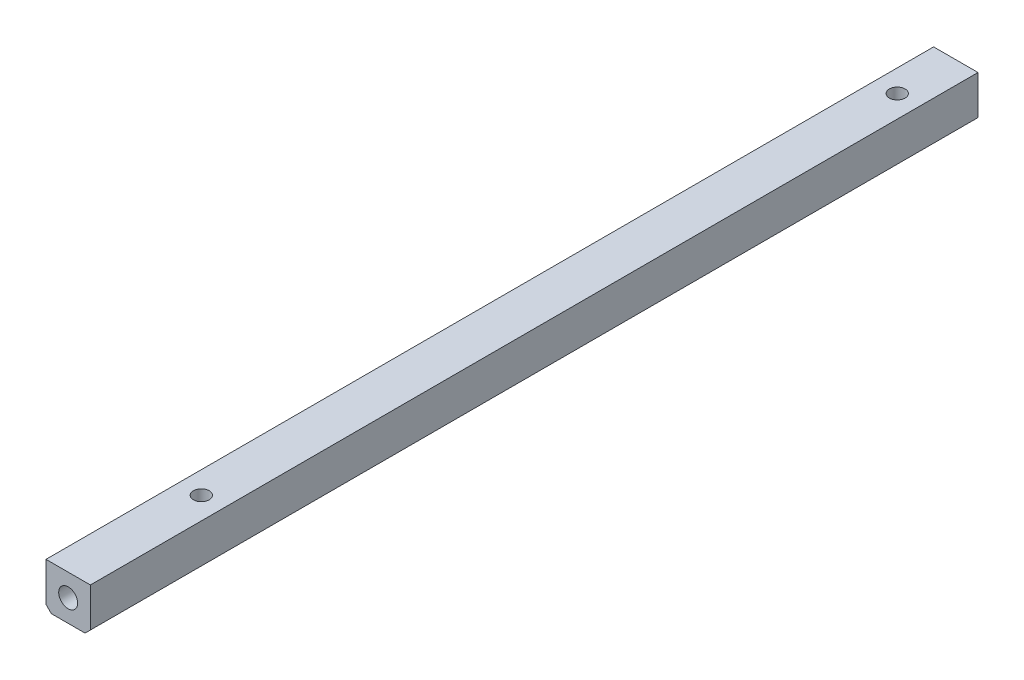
from build123d import *

# Parameters (mm, degrees)
SKETCH1_W          = 6.35
SKETCH1_H          = 6.35
BAR_DEPTH          = 127
SKETCH2_R          = 1.1303
CUT_EXTRUDE1_DEPTH = 128.317104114
SKETCH3_R          = 1.3589
CUT_EXTRUDE2_DEPTH = 12.7
SKETCH4_R          = 1.1303
CUT_EXTRUDE3_DEPTH = 10.16
CHAMFER1_SIZE      = 0.762


with BuildPart() as part:
    # Sketch1 → bar (new body)
    with BuildSketch(Plane.XY):
        with Locations((3.175, 3.175)):
            Rectangle(SKETCH1_W, SKETCH1_H)
    extrude(amount=BAR_DEPTH)

    # Sketch2 → Cut-Extrude1 (cut, through all)
    with BuildSketch(Plane(origin=(0, 6.35, 0), x_dir=(-1, 0, 0), z_dir=(0, 1, 0))):
        with Locations((-3.175, 107.95)):
            Circle(SKETCH2_R)
        with Locations((-3.175, 8.382)):
            Circle(SKETCH2_R)
    extrude(amount=-CUT_EXTRUDE1_DEPTH, mode=Mode.SUBTRACT)

    # Sketch3 → Cut-Extrude2 (cut)
    with BuildSketch(Plane.XY.offset(127)):
        with Locations((3.175, 3.175)):
            Circle(SKETCH3_R)
    extrude(amount=-CUT_EXTRUDE2_DEPTH, mode=Mode.SUBTRACT)

    # Sketch4 → Cut-Extrude3 (cut)
    with BuildSketch(Plane(origin=(0, 0, 0), x_dir=(-1, 0, 0), z_dir=(0, 0, -1))):
        with Locations((-3.175, 3.175)):
            Circle(SKETCH4_R)
    extrude(amount=-CUT_EXTRUDE3_DEPTH, mode=Mode.SUBTRACT)

    # Chamfer1
    chamfer1_edges = [part.edges().sort_by_distance(p)[0] for p in [
        (6.35, 0, 63.5),
        (0, 0, 63.5),
    ]]
    chamfer(chamfer1_edges, length=CHAMFER1_SIZE)


solid = part.part
